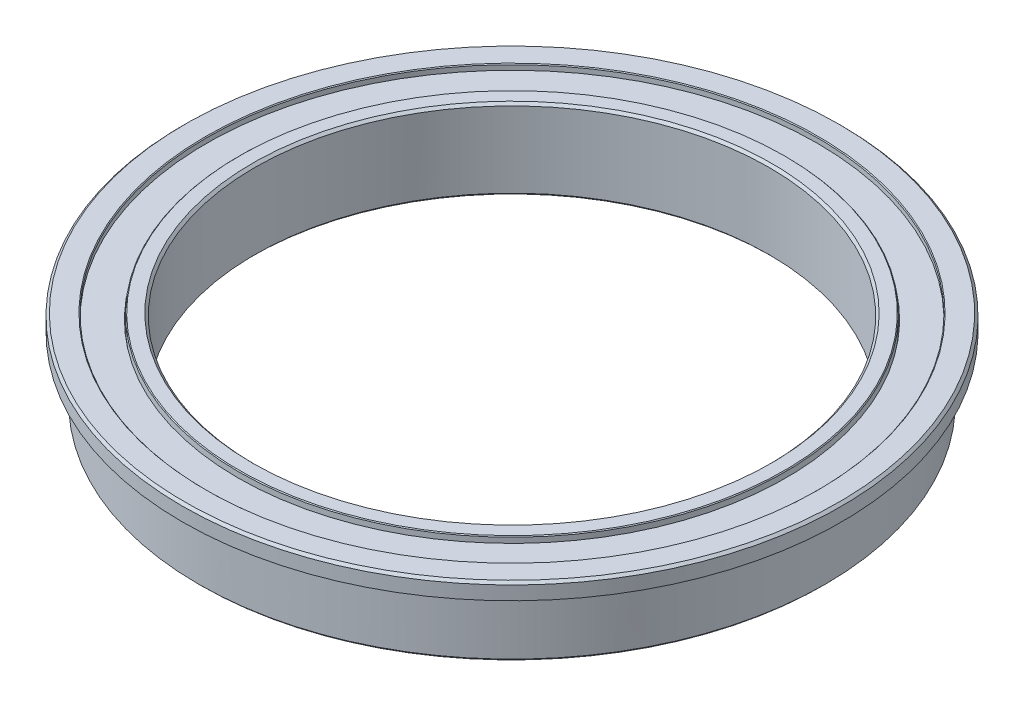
ISO-10303-21;
HEADER;
FILE_DESCRIPTION(('STEP AP214'),'2;1');
FILE_NAME('part.step','',(''),(''),'','','');
FILE_SCHEMA(('AUTOMOTIVE_DESIGN { 1 0 10303 214 1 1 1 1 }'));
ENDSEC;
DATA;
#1=APPLICATION_CONTEXT('core data for automotive mechanical design processes');
#2=APPLICATION_PROTOCOL_DEFINITION('international standard','automotive_design',2000,#1);
#3=PRODUCT_CONTEXT('',#1,'mechanical');
#4=PRODUCT('Part','Part','',(#3));
#5=PRODUCT_RELATED_PRODUCT_CATEGORY('part','',(#4));
#6=PRODUCT_DEFINITION_FORMATION('','',#4);
#7=PRODUCT_DEFINITION_CONTEXT('part definition',#1,'design');
#8=PRODUCT_DEFINITION('design','',#6,#7);
#9=PRODUCT_DEFINITION_SHAPE('','',#8);
#10=(LENGTH_UNIT() NAMED_UNIT(*) SI_UNIT(.MILLI.,.METRE.));
#11=(NAMED_UNIT(*) PLANE_ANGLE_UNIT() SI_UNIT($,.RADIAN.));
#12=(NAMED_UNIT(*) SI_UNIT($,.STERADIAN.) SOLID_ANGLE_UNIT());
#13=UNCERTAINTY_MEASURE_WITH_UNIT(LENGTH_MEASURE(1.E-05),#10,'distance_accuracy_value','');
#14=(GEOMETRIC_REPRESENTATION_CONTEXT(3) GLOBAL_UNCERTAINTY_ASSIGNED_CONTEXT((#13)) GLOBAL_UNIT_ASSIGNED_CONTEXT((#10,
#11,#12)) REPRESENTATION_CONTEXT('',''));
#15=CARTESIAN_POINT('',(0.,0.,0.));
#16=DIRECTION('',(0.,0.,1.));
#17=DIRECTION('',(1.,0.,0.));
#18=AXIS2_PLACEMENT_3D('',#15,#16,#17);
#19=CARTESIAN_POINT('',(0.,0.,0.));
#20=DIRECTION('',(0.,1.,0.));
#21=DIRECTION('',(0.,0.,1.));
#22=AXIS2_PLACEMENT_3D('',#19,#20,#21);
#23=CYLINDRICAL_SURFACE('',#22,19.4);
#24=CARTESIAN_POINT('',(0.,1.5,0.));
#25=DIRECTION('',(0.,1.,0.));
#26=DIRECTION('',(0.,0.,1.));
#27=AXIS2_PLACEMENT_3D('',#24,#25,#26);
#28=CIRCLE('',#27,19.4);
#29=CARTESIAN_POINT('',(0.,1.5,19.4));
#30=VERTEX_POINT('',#29);
#31=EDGE_CURVE('E102',#30,#30,#28,.F.);
#32=ORIENTED_EDGE('',*,*,#31,.T.);
#33=EDGE_LOOP('',(#32));
#34=FACE_BOUND('',#33,.T.);
#35=CARTESIAN_POINT('',(0.,0.95,0.));
#36=DIRECTION('',(0.,1.,0.));
#37=DIRECTION('',(0.,0.,1.));
#38=AXIS2_PLACEMENT_3D('',#35,#36,#37);
#39=CIRCLE('',#38,19.4);
#40=CARTESIAN_POINT('',(0.,0.95,19.4));
#41=VERTEX_POINT('',#40);
#42=EDGE_CURVE('E20',#41,#41,#39,.F.);
#43=ORIENTED_EDGE('',*,*,#42,.F.);
#44=EDGE_LOOP('',(#43));
#45=FACE_BOUND('',#44,.T.);
#46=ADVANCED_FACE('F17',(#34,#45),#23,.T.);
#47=CARTESIAN_POINT('',(19.5,0.95,0.));
#48=DIRECTION('',(0.,1.,0.));
#49=DIRECTION('',(0.,0.,1.));
#50=AXIS2_PLACEMENT_3D('',#47,#48,#49);
#51=PLANE('',#50);
#52=ORIENTED_EDGE('',*,*,#42,.T.);
#53=EDGE_LOOP('',(#52));
#54=FACE_BOUND('',#53,.T.);
#55=CARTESIAN_POINT('',(0.,0.95,0.));
#56=DIRECTION('',(0.,-1.,0.));
#57=DIRECTION('',(0.,0.,-1.));
#58=AXIS2_PLACEMENT_3D('',#55,#56,#57);
#59=CIRCLE('',#58,19.5);
#60=CARTESIAN_POINT('',(0.,0.95,-19.5));
#61=VERTEX_POINT('',#60);
#62=EDGE_CURVE('E100',#61,#61,#59,.T.);
#63=ORIENTED_EDGE('',*,*,#62,.F.);
#64=EDGE_LOOP('',(#63));
#65=FACE_BOUND('',#64,.T.);
#66=ADVANCED_FACE('F109',(#54,#65),#51,.T.);
#67=CARTESIAN_POINT('',(0.,1.5,0.));
#68=DIRECTION('',(0.,1.,0.));
#69=DIRECTION('',(0.,0.,1.));
#70=AXIS2_PLACEMENT_3D('',#67,#68,#69);
#71=PLANE('',#70);
#72=ORIENTED_EDGE('',*,*,#31,.F.);
#73=EDGE_LOOP('',(#72));
#74=FACE_BOUND('',#73,.T.);
#75=CARTESIAN_POINT('',(0.,1.5,0.));
#76=DIRECTION('',(0.,1.,0.));
#77=DIRECTION('',(0.,0.,1.));
#78=AXIS2_PLACEMENT_3D('',#75,#76,#77);
#79=CIRCLE('',#78,20.5);
#80=CARTESIAN_POINT('',(0.,1.5,20.5));
#81=VERTEX_POINT('',#80);
#82=EDGE_CURVE('E55',#81,#81,#79,.T.);
#83=ORIENTED_EDGE('',*,*,#82,.F.);
#84=EDGE_LOOP('',(#83));
#85=FACE_BOUND('',#84,.T.);
#86=ADVANCED_FACE('F117',(#74,#85),#71,.F.);
#87=CARTESIAN_POINT('',(0.,2.5,0.));
#88=DIRECTION('',(0.,-1.,0.));
#89=DIRECTION('',(0.,0.,-1.));
#90=AXIS2_PLACEMENT_3D('',#87,#88,#89);
#91=CYLINDRICAL_SURFACE('',#90,19.5);
#92=ORIENTED_EDGE('',*,*,#62,.T.);
#93=EDGE_LOOP('',(#92));
#94=FACE_BOUND('',#93,.T.);
#95=CARTESIAN_POINT('',(0.,-2.35,0.));
#96=DIRECTION('',(0.,1.,0.));
#97=DIRECTION('',(0.,0.,1.));
#98=AXIS2_PLACEMENT_3D('',#95,#96,#97);
#99=CIRCLE('',#98,19.5);
#100=CARTESIAN_POINT('',(0.,-2.35000000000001,19.5));
#101=VERTEX_POINT('',#100);
#102=EDGE_CURVE('E52',#101,#101,#99,.F.);
#103=ORIENTED_EDGE('',*,*,#102,.F.);
#104=EDGE_LOOP('',(#103));
#105=FACE_BOUND('',#104,.T.);
#106=ADVANCED_FACE('F216',(#94,#105),#91,.T.);
#107=CARTESIAN_POINT('',(0.,1.5,0.));
#108=DIRECTION('',(0.,1.,0.));
#109=DIRECTION('',(0.,0.,1.));
#110=AXIS2_PLACEMENT_3D('',#107,#108,#109);
#111=CYLINDRICAL_SURFACE('',#110,20.5);
#112=CARTESIAN_POINT('',(0.,2.35,0.));
#113=DIRECTION('',(0.,-1.,0.));
#114=DIRECTION('',(0.,0.,-1.));
#115=AXIS2_PLACEMENT_3D('',#112,#113,#114);
#116=CIRCLE('',#115,20.5);
#117=CARTESIAN_POINT('',(0.,2.35,-20.5));
#118=VERTEX_POINT('',#117);
#119=EDGE_CURVE('E48',#118,#118,#116,.F.);
#120=ORIENTED_EDGE('',*,*,#119,.F.);
#121=EDGE_LOOP('',(#120));
#122=FACE_BOUND('',#121,.T.);
#123=ORIENTED_EDGE('',*,*,#82,.T.);
#124=EDGE_LOOP('',(#123));
#125=FACE_BOUND('',#124,.T.);
#126=ADVANCED_FACE('F212',(#122,#125),#111,.T.);
#127=CARTESIAN_POINT('',(0.,-2.35000000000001,0.));
#128=DIRECTION('',(0.,1.,0.));
#129=DIRECTION('',(0.,0.,1.));
#130=AXIS2_PLACEMENT_3D('',#127,#128,#129);
#131=CONICAL_SURFACE('',#130,19.5,0.785398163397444);
#132=CARTESIAN_POINT('',(0.,-2.5,0.));
#133=DIRECTION('',(0.,1.,0.));
#134=DIRECTION('',(0.,0.,1.));
#135=AXIS2_PLACEMENT_3D('',#132,#133,#134);
#136=CIRCLE('',#135,19.35);
#137=CARTESIAN_POINT('',(0.,-2.5,19.35));
#138=VERTEX_POINT('',#137);
#139=EDGE_CURVE('E51',#138,#138,#136,.T.);
#140=ORIENTED_EDGE('',*,*,#139,.T.);
#141=EDGE_LOOP('',(#140));
#142=FACE_BOUND('',#141,.T.);
#143=ORIENTED_EDGE('',*,*,#102,.T.);
#144=EDGE_LOOP('',(#143));
#145=FACE_BOUND('',#144,.T.);
#146=ADVANCED_FACE('F208',(#142,#145),#131,.T.);
#147=CARTESIAN_POINT('',(0.,2.35,0.));
#148=DIRECTION('',(0.,-1.,0.));
#149=DIRECTION('',(0.,0.,-1.));
#150=AXIS2_PLACEMENT_3D('',#147,#148,#149);
#151=CONICAL_SURFACE('',#150,20.5,0.785398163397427);
#152=ORIENTED_EDGE('',*,*,#119,.T.);
#153=EDGE_LOOP('',(#152));
#154=FACE_BOUND('',#153,.T.);
#155=CARTESIAN_POINT('',(0.,2.5,0.));
#156=DIRECTION('',(0.,-1.,0.));
#157=DIRECTION('',(0.,0.,-1.));
#158=AXIS2_PLACEMENT_3D('',#155,#156,#157);
#159=CIRCLE('',#158,20.35);
#160=CARTESIAN_POINT('',(0.,2.5,-20.35));
#161=VERTEX_POINT('',#160);
#162=EDGE_CURVE('E93',#161,#161,#159,.F.);
#163=ORIENTED_EDGE('',*,*,#162,.F.);
#164=EDGE_LOOP('',(#163));
#165=FACE_BOUND('',#164,.T.);
#166=ADVANCED_FACE('F204',(#154,#165),#151,.T.);
#167=CARTESIAN_POINT('',(0.,-2.5,0.));
#168=DIRECTION('',(0.,1.,0.));
#169=DIRECTION('',(0.,0.,1.));
#170=AXIS2_PLACEMENT_3D('',#167,#168,#169);
#171=PLANE('',#170);
#172=ORIENTED_EDGE('',*,*,#139,.F.);
#173=EDGE_LOOP('',(#172));
#174=FACE_BOUND('',#173,.T.);
#175=CARTESIAN_POINT('',(0.,-2.5,0.));
#176=DIRECTION('',(0.,-1.,0.));
#177=DIRECTION('',(0.,0.,-1.));
#178=AXIS2_PLACEMENT_3D('',#175,#176,#177);
#179=CIRCLE('',#178,19.05);
#180=CARTESIAN_POINT('',(0.,-2.5,-19.05));
#181=VERTEX_POINT('',#180);
#182=EDGE_CURVE('E90',#181,#181,#179,.F.);
#183=ORIENTED_EDGE('',*,*,#182,.T.);
#184=EDGE_LOOP('',(#183));
#185=FACE_BOUND('',#184,.T.);
#186=ADVANCED_FACE('F200',(#174,#185),#171,.F.);
#187=CARTESIAN_POINT('',(0.,2.5,0.));
#188=DIRECTION('',(0.,1.,0.));
#189=DIRECTION('',(0.,0.,1.));
#190=AXIS2_PLACEMENT_3D('',#187,#188,#189);
#191=PLANE('',#190);
#192=ORIENTED_EDGE('',*,*,#162,.T.);
#193=EDGE_LOOP('',(#192));
#194=FACE_BOUND('',#193,.T.);
#195=CARTESIAN_POINT('',(0.,2.5,0.));
#196=DIRECTION('',(0.,1.,0.));
#197=DIRECTION('',(-1.,0.,0.));
#198=AXIS2_PLACEMENT_3D('',#195,#196,#197);
#199=CIRCLE('',#198,19.05);
#200=CARTESIAN_POINT('',(-19.05,2.5,0.));
#201=VERTEX_POINT('',#200);
#202=EDGE_CURVE('E47',#201,#201,#199,.F.);
#203=ORIENTED_EDGE('',*,*,#202,.T.);
#204=EDGE_LOOP('',(#203));
#205=FACE_BOUND('',#204,.T.);
#206=ADVANCED_FACE('F196',(#194,#205),#191,.T.);
#207=CARTESIAN_POINT('',(0.,-2.5,0.));
#208=DIRECTION('',(0.,-1.,0.));
#209=DIRECTION('',(0.,0.,-1.));
#210=AXIS2_PLACEMENT_3D('',#207,#208,#209);
#211=CONICAL_SURFACE('',#210,19.05,0.785398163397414);
#212=CARTESIAN_POINT('',(0.,-2.45,0.));
#213=DIRECTION('',(0.,-1.,0.));
#214=DIRECTION('',(0.,0.,-1.));
#215=AXIS2_PLACEMENT_3D('',#212,#213,#214);
#216=CIRCLE('',#215,19.);
#217=CARTESIAN_POINT('',(0.,-2.45,-19.));
#218=VERTEX_POINT('',#217);
#219=EDGE_CURVE('E44',#218,#218,#216,.F.);
#220=ORIENTED_EDGE('',*,*,#219,.T.);
#221=EDGE_LOOP('',(#220));
#222=FACE_BOUND('',#221,.T.);
#223=ORIENTED_EDGE('',*,*,#182,.F.);
#224=EDGE_LOOP('',(#223));
#225=FACE_BOUND('',#224,.T.);
#226=ADVANCED_FACE('F192',(#222,#225),#211,.F.);
#227=CARTESIAN_POINT('',(0.,2.5,0.));
#228=DIRECTION('',(0.,1.,0.));
#229=DIRECTION('',(-1.,0.,0.));
#230=AXIS2_PLACEMENT_3D('',#227,#228,#229);
#231=CONICAL_SURFACE('',#230,19.05,0.785398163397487);
#232=ORIENTED_EDGE('',*,*,#202,.F.);
#233=EDGE_LOOP('',(#232));
#234=FACE_BOUND('',#233,.T.);
#235=CARTESIAN_POINT('',(0.,2.45,0.));
#236=DIRECTION('',(0.,1.,0.));
#237=DIRECTION('',(0.,0.,1.));
#238=AXIS2_PLACEMENT_3D('',#235,#236,#237);
#239=CIRCLE('',#238,19.);
#240=CARTESIAN_POINT('',(0.,2.45,19.));
#241=VERTEX_POINT('',#240);
#242=EDGE_CURVE('E40',#241,#241,#239,.F.);
#243=ORIENTED_EDGE('',*,*,#242,.T.);
#244=EDGE_LOOP('',(#243));
#245=FACE_BOUND('',#244,.T.);
#246=ADVANCED_FACE('F188',(#234,#245),#231,.F.);
#247=CARTESIAN_POINT('',(0.,-2.15,0.));
#248=DIRECTION('',(0.,-1.,0.));
#249=DIRECTION('',(0.,0.,-1.));
#250=AXIS2_PLACEMENT_3D('',#247,#248,#249);
#251=CYLINDRICAL_SURFACE('',#250,19.);
#252=CARTESIAN_POINT('',(0.,-2.15,0.));
#253=DIRECTION('',(0.,-1.,0.));
#254=DIRECTION('',(0.,0.,-1.));
#255=AXIS2_PLACEMENT_3D('',#252,#253,#254);
#256=CIRCLE('',#255,19.);
#257=CARTESIAN_POINT('',(0.,-2.15,-19.));
#258=VERTEX_POINT('',#257);
#259=EDGE_CURVE('E43',#258,#258,#256,.T.);
#260=ORIENTED_EDGE('',*,*,#259,.F.);
#261=EDGE_LOOP('',(#260));
#262=FACE_BOUND('',#261,.T.);
#263=ORIENTED_EDGE('',*,*,#219,.F.);
#264=EDGE_LOOP('',(#263));
#265=FACE_BOUND('',#264,.T.);
#266=ADVANCED_FACE('F184',(#262,#265),#251,.F.);
#267=CARTESIAN_POINT('',(0.,2.15,0.));
#268=DIRECTION('',(0.,1.,0.));
#269=DIRECTION('',(0.,0.,1.));
#270=AXIS2_PLACEMENT_3D('',#267,#268,#269);
#271=CYLINDRICAL_SURFACE('',#270,19.);
#272=ORIENTED_EDGE('',*,*,#242,.F.);
#273=EDGE_LOOP('',(#272));
#274=FACE_BOUND('',#273,.T.);
#275=CARTESIAN_POINT('',(0.,2.15,0.));
#276=DIRECTION('',(0.,1.,0.));
#277=DIRECTION('',(0.,0.,1.));
#278=AXIS2_PLACEMENT_3D('',#275,#276,#277);
#279=CIRCLE('',#278,19.);
#280=CARTESIAN_POINT('',(0.,2.15,19.));
#281=VERTEX_POINT('',#280);
#282=EDGE_CURVE('E83',#281,#281,#279,.T.);
#283=ORIENTED_EDGE('',*,*,#282,.F.);
#284=EDGE_LOOP('',(#283));
#285=FACE_BOUND('',#284,.T.);
#286=ADVANCED_FACE('F180',(#274,#285),#271,.F.);
#287=CARTESIAN_POINT('',(0.,-2.15,0.));
#288=DIRECTION('',(0.,-1.,0.));
#289=DIRECTION('',(0.,0.,-1.));
#290=AXIS2_PLACEMENT_3D('',#287,#288,#289);
#291=PLANE('',#290);
#292=CARTESIAN_POINT('',(0.,-2.15,0.));
#293=DIRECTION('',(0.,-1.,0.));
#294=DIRECTION('',(0.,0.,-1.));
#295=AXIS2_PLACEMENT_3D('',#292,#293,#294);
#296=CIRCLE('',#295,17.05);
#297=CARTESIAN_POINT('',(0.,-2.15,-17.05));
#298=VERTEX_POINT('',#297);
#299=EDGE_CURVE('E80',#298,#298,#296,.F.);
#300=ORIENTED_EDGE('',*,*,#299,.T.);
#301=EDGE_LOOP('',(#300));
#302=FACE_BOUND('',#301,.T.);
#303=ORIENTED_EDGE('',*,*,#259,.T.);
#304=EDGE_LOOP('',(#303));
#305=FACE_BOUND('',#304,.T.);
#306=ADVANCED_FACE('F176',(#302,#305),#291,.T.);
#307=CARTESIAN_POINT('',(0.,2.15,0.));
#308=DIRECTION('',(0.,1.,0.));
#309=DIRECTION('',(0.,0.,1.));
#310=AXIS2_PLACEMENT_3D('',#307,#308,#309);
#311=PLANE('',#310);
#312=ORIENTED_EDGE('',*,*,#282,.T.);
#313=EDGE_LOOP('',(#312));
#314=FACE_BOUND('',#313,.T.);
#315=CARTESIAN_POINT('',(0.,2.15,0.));
#316=DIRECTION('',(0.,1.,0.));
#317=DIRECTION('',(0.,0.,1.));
#318=AXIS2_PLACEMENT_3D('',#315,#316,#317);
#319=CIRCLE('',#318,17.05);
#320=CARTESIAN_POINT('',(0.,2.15,17.05));
#321=VERTEX_POINT('',#320);
#322=EDGE_CURVE('E77',#321,#321,#319,.F.);
#323=ORIENTED_EDGE('',*,*,#322,.T.);
#324=EDGE_LOOP('',(#323));
#325=FACE_BOUND('',#324,.T.);
#326=ADVANCED_FACE('F172',(#314,#325),#311,.T.);
#327=CARTESIAN_POINT('',(0.,-1.8,0.));
#328=DIRECTION('',(0.,-1.,0.));
#329=DIRECTION('',(0.,0.,-1.));
#330=AXIS2_PLACEMENT_3D('',#327,#328,#329);
#331=CYLINDRICAL_SURFACE('',#330,17.05);
#332=CARTESIAN_POINT('',(0.,-1.8,0.));
#333=DIRECTION('',(0.,-1.,0.));
#334=DIRECTION('',(0.,0.,-1.));
#335=AXIS2_PLACEMENT_3D('',#332,#333,#334);
#336=CIRCLE('',#335,17.05);
#337=CARTESIAN_POINT('',(0.,-1.8,-17.05));
#338=VERTEX_POINT('',#337);
#339=EDGE_CURVE('E74',#338,#338,#336,.T.);
#340=ORIENTED_EDGE('',*,*,#339,.F.);
#341=EDGE_LOOP('',(#340));
#342=FACE_BOUND('',#341,.T.);
#343=ORIENTED_EDGE('',*,*,#299,.F.);
#344=EDGE_LOOP('',(#343));
#345=FACE_BOUND('',#344,.T.);
#346=ADVANCED_FACE('F168',(#342,#345),#331,.F.);
#347=CARTESIAN_POINT('',(0.,1.8,0.));
#348=DIRECTION('',(0.,1.,0.));
#349=DIRECTION('',(0.,0.,1.));
#350=AXIS2_PLACEMENT_3D('',#347,#348,#349);
#351=CYLINDRICAL_SURFACE('',#350,17.05);
#352=ORIENTED_EDGE('',*,*,#322,.F.);
#353=EDGE_LOOP('',(#352));
#354=FACE_BOUND('',#353,.T.);
#355=CARTESIAN_POINT('',(0.,1.8,0.));
#356=DIRECTION('',(0.,1.,0.));
#357=DIRECTION('',(0.,0.,1.));
#358=AXIS2_PLACEMENT_3D('',#355,#356,#357);
#359=CIRCLE('',#358,17.05);
#360=CARTESIAN_POINT('',(0.,1.8,17.05));
#361=VERTEX_POINT('',#360);
#362=EDGE_CURVE('E71',#361,#361,#359,.T.);
#363=ORIENTED_EDGE('',*,*,#362,.F.);
#364=EDGE_LOOP('',(#363));
#365=FACE_BOUND('',#364,.T.);
#366=ADVANCED_FACE('F164',(#354,#365),#351,.F.);
#367=CARTESIAN_POINT('',(0.,-1.8,0.));
#368=DIRECTION('',(0.,-1.,0.));
#369=DIRECTION('',(0.,0.,-1.));
#370=AXIS2_PLACEMENT_3D('',#367,#368,#369);
#371=PLANE('',#370);
#372=CARTESIAN_POINT('',(0.,-1.8,0.));
#373=DIRECTION('',(0.,-1.,0.));
#374=DIRECTION('',(0.,0.,-1.));
#375=AXIS2_PLACEMENT_3D('',#372,#373,#374);
#376=CIRCLE('',#375,17.);
#377=CARTESIAN_POINT('',(0.,-1.8,-17.));
#378=VERTEX_POINT('',#377);
#379=EDGE_CURVE('E68',#378,#378,#376,.T.);
#380=ORIENTED_EDGE('',*,*,#379,.F.);
#381=EDGE_LOOP('',(#380));
#382=FACE_BOUND('',#381,.T.);
#383=ORIENTED_EDGE('',*,*,#339,.T.);
#384=EDGE_LOOP('',(#383));
#385=FACE_BOUND('',#384,.T.);
#386=ADVANCED_FACE('F160',(#382,#385),#371,.T.);
#387=CARTESIAN_POINT('',(0.,1.8,0.));
#388=DIRECTION('',(0.,1.,0.));
#389=DIRECTION('',(0.,0.,1.));
#390=AXIS2_PLACEMENT_3D('',#387,#388,#389);
#391=PLANE('',#390);
#392=ORIENTED_EDGE('',*,*,#362,.T.);
#393=EDGE_LOOP('',(#392));
#394=FACE_BOUND('',#393,.T.);
#395=CARTESIAN_POINT('',(0.,1.8,0.));
#396=DIRECTION('',(0.,1.,0.));
#397=DIRECTION('',(0.,0.,1.));
#398=AXIS2_PLACEMENT_3D('',#395,#396,#397);
#399=CIRCLE('',#398,17.);
#400=CARTESIAN_POINT('',(0.,1.8,17.));
#401=VERTEX_POINT('',#400);
#402=EDGE_CURVE('E39',#401,#401,#399,.T.);
#403=ORIENTED_EDGE('',*,*,#402,.F.);
#404=EDGE_LOOP('',(#403));
#405=FACE_BOUND('',#404,.T.);
#406=ADVANCED_FACE('F156',(#394,#405),#391,.T.);
#407=CARTESIAN_POINT('',(0.,-2.15,0.));
#408=DIRECTION('',(0.,-1.,0.));
#409=DIRECTION('',(0.,0.,-1.));
#410=AXIS2_PLACEMENT_3D('',#407,#408,#409);
#411=CYLINDRICAL_SURFACE('',#410,17.);
#412=ORIENTED_EDGE('',*,*,#379,.T.);
#413=EDGE_LOOP('',(#412));
#414=FACE_BOUND('',#413,.T.);
#415=CARTESIAN_POINT('',(0.,-2.45,0.));
#416=DIRECTION('',(0.,1.,0.));
#417=DIRECTION('',(0.,0.,1.));
#418=AXIS2_PLACEMENT_3D('',#415,#416,#417);
#419=CIRCLE('',#418,17.);
#420=CARTESIAN_POINT('',(0.,-2.45000000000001,17.));
#421=VERTEX_POINT('',#420);
#422=EDGE_CURVE('E36',#421,#421,#419,.F.);
#423=ORIENTED_EDGE('',*,*,#422,.F.);
#424=EDGE_LOOP('',(#423));
#425=FACE_BOUND('',#424,.T.);
#426=ADVANCED_FACE('F152',(#414,#425),#411,.T.);
#427=CARTESIAN_POINT('',(0.,2.15,0.));
#428=DIRECTION('',(0.,1.,0.));
#429=DIRECTION('',(0.,0.,1.));
#430=AXIS2_PLACEMENT_3D('',#427,#428,#429);
#431=CYLINDRICAL_SURFACE('',#430,17.);
#432=CARTESIAN_POINT('',(0.,2.45000000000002,0.));
#433=DIRECTION('',(0.,-1.,0.));
#434=DIRECTION('',(0.,0.,-1.));
#435=AXIS2_PLACEMENT_3D('',#432,#433,#434);
#436=CIRCLE('',#435,17.);
#437=CARTESIAN_POINT('',(0.,2.45000000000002,-17.));
#438=VERTEX_POINT('',#437);
#439=EDGE_CURVE('E32',#438,#438,#436,.F.);
#440=ORIENTED_EDGE('',*,*,#439,.F.);
#441=EDGE_LOOP('',(#440));
#442=FACE_BOUND('',#441,.T.);
#443=ORIENTED_EDGE('',*,*,#402,.T.);
#444=EDGE_LOOP('',(#443));
#445=FACE_BOUND('',#444,.T.);
#446=ADVANCED_FACE('F148',(#442,#445),#431,.T.);
#447=CARTESIAN_POINT('',(0.,-2.45000000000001,0.));
#448=DIRECTION('',(0.,1.,0.));
#449=DIRECTION('',(-1.,0.,0.));
#450=AXIS2_PLACEMENT_3D('',#447,#448,#449);
#451=CONICAL_SURFACE('',#450,17.,0.785398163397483);
#452=CARTESIAN_POINT('',(0.,-2.5,0.));
#453=DIRECTION('',(0.,1.,0.));
#454=DIRECTION('',(-1.,0.,0.));
#455=AXIS2_PLACEMENT_3D('',#452,#453,#454);
#456=CIRCLE('',#455,16.95);
#457=CARTESIAN_POINT('',(-16.95,-2.5,0.));
#458=VERTEX_POINT('',#457);
#459=EDGE_CURVE('E35',#458,#458,#456,.T.);
#460=ORIENTED_EDGE('',*,*,#459,.T.);
#461=EDGE_LOOP('',(#460));
#462=FACE_BOUND('',#461,.T.);
#463=ORIENTED_EDGE('',*,*,#422,.T.);
#464=EDGE_LOOP('',(#463));
#465=FACE_BOUND('',#464,.T.);
#466=ADVANCED_FACE('F144',(#462,#465),#451,.T.);
#467=CARTESIAN_POINT('',(0.,2.45000000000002,0.));
#468=DIRECTION('',(0.,-1.,0.));
#469=DIRECTION('',(0.,0.,-1.));
#470=AXIS2_PLACEMENT_3D('',#467,#468,#469);
#471=CONICAL_SURFACE('',#470,17.,0.785398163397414);
#472=ORIENTED_EDGE('',*,*,#439,.T.);
#473=EDGE_LOOP('',(#472));
#474=FACE_BOUND('',#473,.T.);
#475=CARTESIAN_POINT('',(0.,2.5,0.));
#476=DIRECTION('',(0.,-1.,0.));
#477=DIRECTION('',(0.,0.,-1.));
#478=AXIS2_PLACEMENT_3D('',#475,#476,#477);
#479=CIRCLE('',#478,16.95);
#480=CARTESIAN_POINT('',(0.,2.5,-16.95));
#481=VERTEX_POINT('',#480);
#482=EDGE_CURVE('E61',#481,#481,#479,.F.);
#483=ORIENTED_EDGE('',*,*,#482,.F.);
#484=EDGE_LOOP('',(#483));
#485=FACE_BOUND('',#484,.T.);
#486=ADVANCED_FACE('F140',(#474,#485),#471,.T.);
#487=CARTESIAN_POINT('',(0.,-2.5,0.));
#488=DIRECTION('',(0.,1.,0.));
#489=DIRECTION('',(0.,0.,1.));
#490=AXIS2_PLACEMENT_3D('',#487,#488,#489);
#491=PLANE('',#490);
#492=CARTESIAN_POINT('',(0.,-2.5,0.));
#493=DIRECTION('',(0.,-1.,0.));
#494=DIRECTION('',(0.,0.,-1.));
#495=AXIS2_PLACEMENT_3D('',#492,#493,#494);
#496=CIRCLE('',#495,16.15);
#497=CARTESIAN_POINT('',(0.,-2.5,-16.15));
#498=VERTEX_POINT('',#497);
#499=EDGE_CURVE('E58',#498,#498,#496,.F.);
#500=ORIENTED_EDGE('',*,*,#499,.T.);
#501=EDGE_LOOP('',(#500));
#502=FACE_BOUND('',#501,.T.);
#503=ORIENTED_EDGE('',*,*,#459,.F.);
#504=EDGE_LOOP('',(#503));
#505=FACE_BOUND('',#504,.T.);
#506=ADVANCED_FACE('F136',(#502,#505),#491,.F.);
#507=CARTESIAN_POINT('',(0.,2.5,0.));
#508=DIRECTION('',(0.,1.,0.));
#509=DIRECTION('',(0.,0.,1.));
#510=AXIS2_PLACEMENT_3D('',#507,#508,#509);
#511=PLANE('',#510);
#512=CARTESIAN_POINT('',(0.,2.5,0.));
#513=DIRECTION('',(0.,1.,0.));
#514=DIRECTION('',(0.,0.,1.));
#515=AXIS2_PLACEMENT_3D('',#512,#513,#514);
#516=CIRCLE('',#515,16.15);
#517=CARTESIAN_POINT('',(0.,2.5,16.15));
#518=VERTEX_POINT('',#517);
#519=EDGE_CURVE('E29',#518,#518,#516,.F.);
#520=ORIENTED_EDGE('',*,*,#519,.T.);
#521=EDGE_LOOP('',(#520));
#522=FACE_BOUND('',#521,.T.);
#523=ORIENTED_EDGE('',*,*,#482,.T.);
#524=EDGE_LOOP('',(#523));
#525=FACE_BOUND('',#524,.T.);
#526=ADVANCED_FACE('F132',(#522,#525),#511,.T.);
#527=CARTESIAN_POINT('',(0.,-2.5,0.));
#528=DIRECTION('',(0.,-1.,0.));
#529=DIRECTION('',(0.,0.,-1.));
#530=AXIS2_PLACEMENT_3D('',#527,#528,#529);
#531=CONICAL_SURFACE('',#530,16.15,0.785398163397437);
#532=CARTESIAN_POINT('',(0.,-2.35,0.));
#533=DIRECTION('',(0.,-1.,0.));
#534=DIRECTION('',(0.,0.,-1.));
#535=AXIS2_PLACEMENT_3D('',#532,#533,#534);
#536=CIRCLE('',#535,16.);
#537=CARTESIAN_POINT('',(0.,-2.35,-16.));
#538=VERTEX_POINT('',#537);
#539=EDGE_CURVE('E24',#538,#538,#536,.F.);
#540=ORIENTED_EDGE('',*,*,#539,.T.);
#541=EDGE_LOOP('',(#540));
#542=FACE_BOUND('',#541,.T.);
#543=ORIENTED_EDGE('',*,*,#499,.F.);
#544=EDGE_LOOP('',(#543));
#545=FACE_BOUND('',#544,.T.);
#546=ADVANCED_FACE('F126',(#542,#545),#531,.F.);
#547=CARTESIAN_POINT('',(0.,2.5,0.));
#548=DIRECTION('',(0.,1.,0.));
#549=DIRECTION('',(0.,0.,1.));
#550=AXIS2_PLACEMENT_3D('',#547,#548,#549);
#551=CONICAL_SURFACE('',#550,16.15,0.785398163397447);
#552=CARTESIAN_POINT('',(0.,2.35,0.));
#553=DIRECTION('',(0.,-1.,0.));
#554=DIRECTION('',(0.,0.,-1.));
#555=AXIS2_PLACEMENT_3D('',#552,#553,#554);
#556=CIRCLE('',#555,16.);
#557=CARTESIAN_POINT('',(0.,2.35,-16.));
#558=VERTEX_POINT('',#557);
#559=EDGE_CURVE('E10',#558,#558,#556,.T.);
#560=ORIENTED_EDGE('',*,*,#559,.T.);
#561=EDGE_LOOP('',(#560));
#562=FACE_BOUND('',#561,.T.);
#563=ORIENTED_EDGE('',*,*,#519,.F.);
#564=EDGE_LOOP('',(#563));
#565=FACE_BOUND('',#564,.T.);
#566=ADVANCED_FACE('F120',(#562,#565),#551,.F.);
#567=CARTESIAN_POINT('',(0.,2.5,0.));
#568=DIRECTION('',(0.,-1.,0.));
#569=DIRECTION('',(0.,0.,-1.));
#570=AXIS2_PLACEMENT_3D('',#567,#568,#569);
#571=CYLINDRICAL_SURFACE('',#570,16.);
#572=ORIENTED_EDGE('',*,*,#559,.F.);
#573=EDGE_LOOP('',(#572));
#574=FACE_BOUND('',#573,.T.);
#575=ORIENTED_EDGE('',*,*,#539,.F.);
#576=EDGE_LOOP('',(#575));
#577=FACE_BOUND('',#576,.T.);
#578=ADVANCED_FACE('F118',(#574,#577),#571,.F.);
#579=CLOSED_SHELL('',(#46,#66,#86,#106,#126,#146,#166,#186,#206,#226,#246,#266,#286,#306,#326,
#346,#366,#386,#406,#426,#446,#466,#486,#506,#526,#546,#566,#578));
#580=MANIFOLD_SOLID_BREP('B1',#579);
#581=ADVANCED_BREP_SHAPE_REPRESENTATION('',(#18,#580),#14);
#582=SHAPE_DEFINITION_REPRESENTATION(#9,#581);
ENDSEC;
END-ISO-10303-21;
